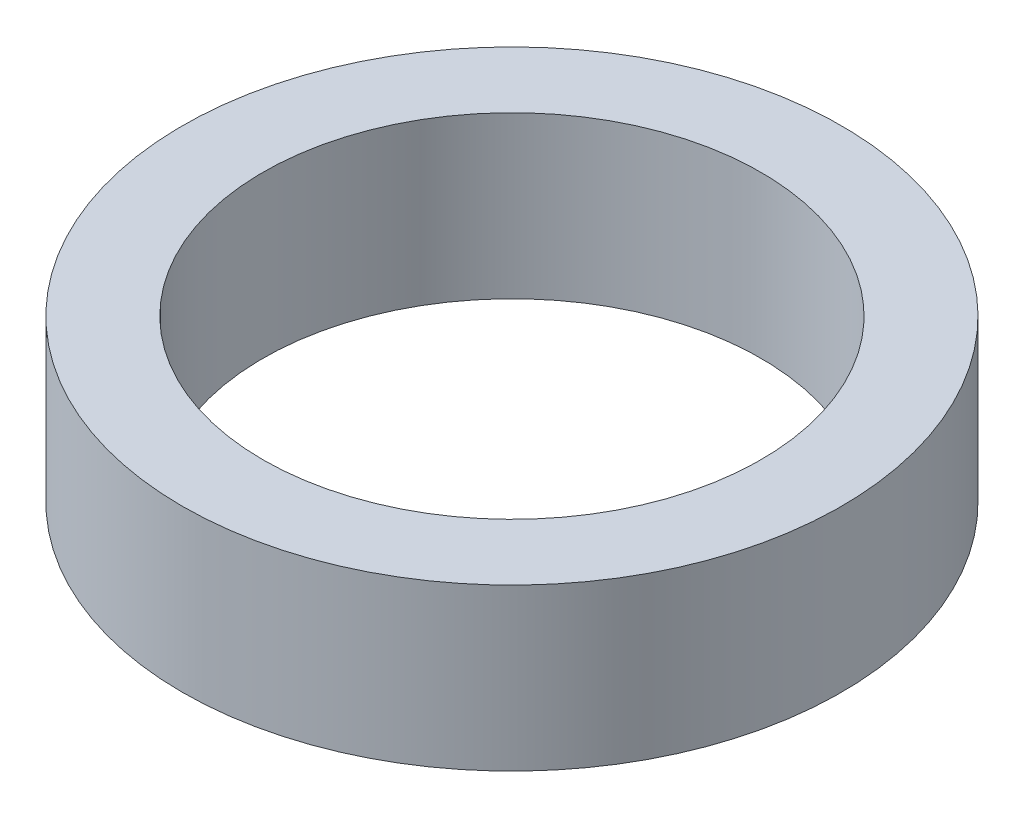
ISO-10303-21;
HEADER;
FILE_DESCRIPTION(('STEP AP214'),'2;1');
FILE_NAME('part.step','',(''),(''),'','','');
FILE_SCHEMA(('AUTOMOTIVE_DESIGN { 1 0 10303 214 1 1 1 1 }'));
ENDSEC;
DATA;
#1=APPLICATION_CONTEXT('core data for automotive mechanical design processes');
#2=APPLICATION_PROTOCOL_DEFINITION('international standard','automotive_design',2000,#1);
#3=PRODUCT_CONTEXT('',#1,'mechanical');
#4=PRODUCT('Part','Part','',(#3));
#5=PRODUCT_RELATED_PRODUCT_CATEGORY('part','',(#4));
#6=PRODUCT_DEFINITION_FORMATION('','',#4);
#7=PRODUCT_DEFINITION_CONTEXT('part definition',#1,'design');
#8=PRODUCT_DEFINITION('design','',#6,#7);
#9=PRODUCT_DEFINITION_SHAPE('','',#8);
#10=(LENGTH_UNIT() NAMED_UNIT(*) SI_UNIT(.MILLI.,.METRE.));
#11=(NAMED_UNIT(*) PLANE_ANGLE_UNIT() SI_UNIT($,.RADIAN.));
#12=(NAMED_UNIT(*) SI_UNIT($,.STERADIAN.) SOLID_ANGLE_UNIT());
#13=UNCERTAINTY_MEASURE_WITH_UNIT(LENGTH_MEASURE(1.E-05),#10,'distance_accuracy_value','');
#14=(GEOMETRIC_REPRESENTATION_CONTEXT(3) GLOBAL_UNCERTAINTY_ASSIGNED_CONTEXT((#13)) GLOBAL_UNIT_ASSIGNED_CONTEXT((#10,
#11,#12)) REPRESENTATION_CONTEXT('',''));
#15=CARTESIAN_POINT('',(0.,0.,0.));
#16=DIRECTION('',(0.,0.,1.));
#17=DIRECTION('',(1.,0.,0.));
#18=AXIS2_PLACEMENT_3D('',#15,#16,#17);
#19=CARTESIAN_POINT('',(0.,11.,0.));
#20=DIRECTION('',(0.,1.,0.));
#21=DIRECTION('',(0.,0.,1.));
#22=AXIS2_PLACEMENT_3D('',#19,#20,#21);
#23=PLANE('',#22);
#24=CARTESIAN_POINT('',(0.,11.,0.));
#25=DIRECTION('',(0.,1.,0.));
#26=DIRECTION('',(0.,0.,1.));
#27=AXIS2_PLACEMENT_3D('',#24,#25,#26);
#28=CIRCLE('',#27,22.5);
#29=CARTESIAN_POINT('',(0.,11.,22.5));
#30=VERTEX_POINT('',#29);
#31=EDGE_CURVE('E10',#30,#30,#28,.T.);
#32=ORIENTED_EDGE('',*,*,#31,.T.);
#33=EDGE_LOOP('',(#32));
#34=FACE_BOUND('',#33,.T.);
#35=CARTESIAN_POINT('',(0.,11.,0.));
#36=DIRECTION('',(0.,1.,0.));
#37=DIRECTION('',(0.,0.,1.));
#38=AXIS2_PLACEMENT_3D('',#35,#36,#37);
#39=CIRCLE('',#38,17.);
#40=CARTESIAN_POINT('',(0.,11.,17.));
#41=VERTEX_POINT('',#40);
#42=EDGE_CURVE('E43',#41,#41,#39,.T.);
#43=ORIENTED_EDGE('',*,*,#42,.F.);
#44=EDGE_LOOP('',(#43));
#45=FACE_BOUND('',#44,.T.);
#46=ADVANCED_FACE('F32',(#34,#45),#23,.T.);
#47=CARTESIAN_POINT('',(0.,0.,0.));
#48=DIRECTION('',(0.,1.,0.));
#49=DIRECTION('',(0.,0.,1.));
#50=AXIS2_PLACEMENT_3D('',#47,#48,#49);
#51=PLANE('',#50);
#52=CARTESIAN_POINT('',(0.,0.,0.));
#53=DIRECTION('',(0.,1.,0.));
#54=DIRECTION('',(0.,0.,1.));
#55=AXIS2_PLACEMENT_3D('',#52,#53,#54);
#56=CIRCLE('',#55,22.5);
#57=CARTESIAN_POINT('',(0.,0.,22.5));
#58=VERTEX_POINT('',#57);
#59=EDGE_CURVE('E36',#58,#58,#56,.T.);
#60=ORIENTED_EDGE('',*,*,#59,.F.);
#61=EDGE_LOOP('',(#60));
#62=FACE_BOUND('',#61,.T.);
#63=CARTESIAN_POINT('',(0.,0.,0.));
#64=DIRECTION('',(0.,1.,0.));
#65=DIRECTION('',(0.,0.,1.));
#66=AXIS2_PLACEMENT_3D('',#63,#64,#65);
#67=CIRCLE('',#66,17.);
#68=CARTESIAN_POINT('',(0.,0.,17.));
#69=VERTEX_POINT('',#68);
#70=EDGE_CURVE('E45',#69,#69,#67,.T.);
#71=ORIENTED_EDGE('',*,*,#70,.T.);
#72=EDGE_LOOP('',(#71));
#73=FACE_BOUND('',#72,.T.);
#74=ADVANCED_FACE('F55',(#62,#73),#51,.F.);
#75=CARTESIAN_POINT('',(0.,11.,0.));
#76=DIRECTION('',(0.,-1.,0.));
#77=DIRECTION('',(0.,0.,-1.));
#78=AXIS2_PLACEMENT_3D('',#75,#76,#77);
#79=CYLINDRICAL_SURFACE('',#78,22.5);
#80=ORIENTED_EDGE('',*,*,#31,.F.);
#81=EDGE_LOOP('',(#80));
#82=FACE_BOUND('',#81,.T.);
#83=ORIENTED_EDGE('',*,*,#59,.T.);
#84=EDGE_LOOP('',(#83));
#85=FACE_BOUND('',#84,.T.);
#86=ADVANCED_FACE('F34',(#82,#85),#79,.T.);
#87=CARTESIAN_POINT('',(0.,11.,0.));
#88=DIRECTION('',(0.,-1.,0.));
#89=DIRECTION('',(0.,0.,-1.));
#90=AXIS2_PLACEMENT_3D('',#87,#88,#89);
#91=CYLINDRICAL_SURFACE('',#90,17.);
#92=ORIENTED_EDGE('',*,*,#42,.T.);
#93=EDGE_LOOP('',(#92));
#94=FACE_BOUND('',#93,.T.);
#95=ORIENTED_EDGE('',*,*,#70,.F.);
#96=EDGE_LOOP('',(#95));
#97=FACE_BOUND('',#96,.T.);
#98=ADVANCED_FACE('F51',(#94,#97),#91,.F.);
#99=CLOSED_SHELL('',(#46,#74,#86,#98));
#100=MANIFOLD_SOLID_BREP('B2',#99);
#101=ADVANCED_BREP_SHAPE_REPRESENTATION('',(#18,#100),#14);
#102=SHAPE_DEFINITION_REPRESENTATION(#9,#101);
ENDSEC;
END-ISO-10303-21;
